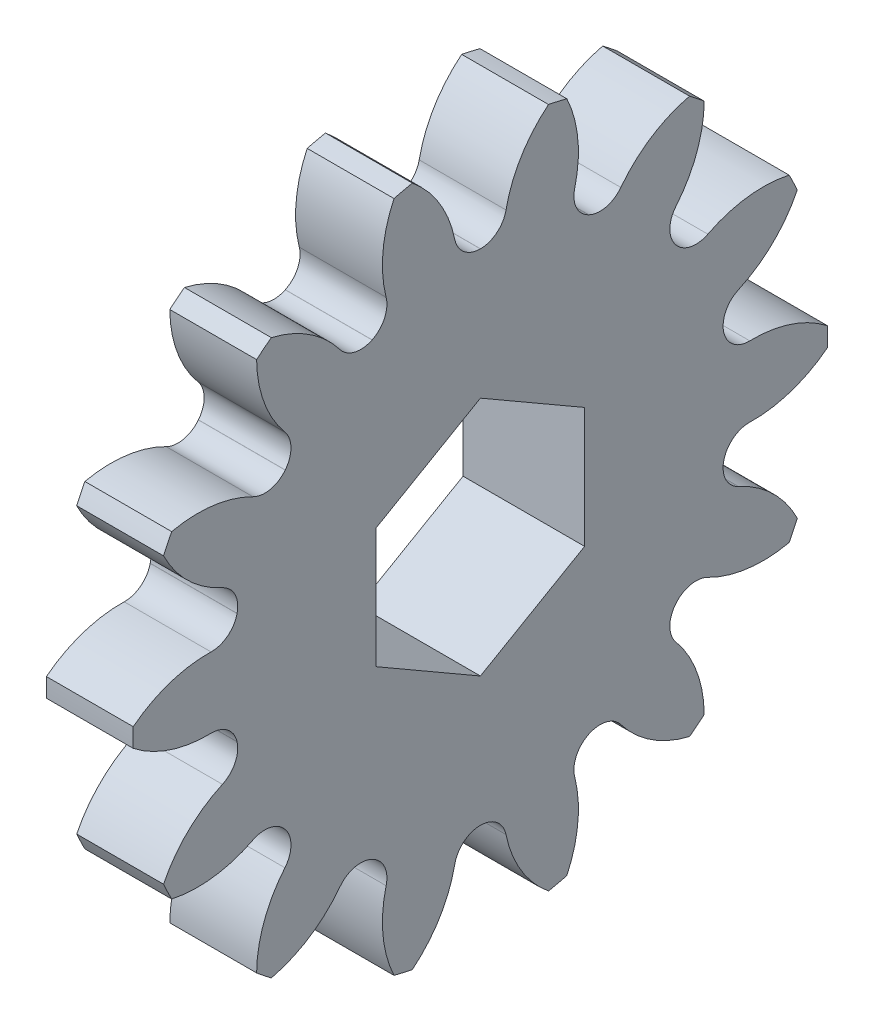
from build123d import *

# Parameters (mm, degrees)
SKETCH1_W           = 10
SKETCH1_H           = 40
CUT_EXTRUDE1_DEPTH  = 58.445626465
CUT_EXTRUDE2_DEPTH  = 58.445626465
CUT_EXTRUDE3_DEPTH  = 58.445626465
CUT_EXTRUDE4_DEPTH  = 58.445626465
CUT_EXTRUDE5_DEPTH  = 58.445626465
CUT_EXTRUDE6_DEPTH  = 58.445626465
CUT_EXTRUDE7_DEPTH  = 58.445626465
CUT_EXTRUDE8_DEPTH  = 58.445626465
CUT_EXTRUDE9_DEPTH  = 58.445626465
CUT_EXTRUDE10_DEPTH = 58.445626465
CUT_EXTRUDE11_DEPTH = 58.445626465
CUT_EXTRUDE12_DEPTH = 58.445626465
CUT_EXTRUDE13_DEPTH = 58.445626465
CUT_EXTRUDE14_DEPTH = 57.907686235
SKETCH16_R          = 19.5
BOSS_EXTRUDE1_DEPTH = 4
FILLET1_R           = 3
CUT_EXTRUDE16_DEPTH = 58.744997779


with BuildPart() as part:
    # Sketch1 → Revolve1 (revolve)
    with BuildSketch(Plane(origin=(0, 0, 0), x_dir=(-1, 0, 0), z_dir=(0, 0, -1)), mode=Mode.PRIVATE) as revolve1_sk:
        with Locations((-5, 20)):
            Rectangle(SKETCH1_W, SKETCH1_H)
    revolve(revolve1_sk.sketch.rotate(Axis((10, 0, 0), (-1, 0, 0)), 270), axis=Axis((10, 0, 0), (-1, 0, 0)))

    # Sketch2 → Cut-Extrude1 (cut, through all)
    with BuildSketch(Plane(origin=(10, 0, 0), x_dir=(0, 0, -1), z_dir=(1, 0, 0))):
        with BuildLine():
            ThreePointArc((35.556318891, 18.323432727), (31.273259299, 24.939592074), (25.7760513, 30.587500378))
            ThreePointArc((25.7760513, 30.587500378), (24.422511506, 24.701855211), (20.71573776, 19.933971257))
            ThreePointArc((20.71573776, 19.933971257), (22.476873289, 17.924708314), (24.043870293, 15.760625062))
            ThreePointArc((24.043870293, 15.760625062), (29.517048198, 18.313508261), (35.556318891, 18.323432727))
        make_face()
    extrude(amount=-CUT_EXTRUDE1_DEPTH, mode=Mode.SUBTRACT)

    # Sketch3 → Cut-Extrude2 (cut, through all)
    with BuildSketch(Plane(origin=(10, 0, 0), x_dir=(0, 0, -1), z_dir=(1, 0, 0))):
        with BuildLine():
            ThreePointArc((39.985375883, 1.08153385), (38.997116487, 8.900837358), (36.494838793, 16.37457607))
            ThreePointArc((36.494838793, 16.37457607), (32.721655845, 11.659071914), (27.313260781, 8.971665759))
            ThreePointArc((27.313260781, 8.971665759), (28.028202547, 6.39725433), (28.50105753, 3.767588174))
            ThreePointArc((28.50105753, 3.767588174), (34.539874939, 3.692933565), (39.985375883, 1.08153385))
        make_face()
    extrude(amount=-CUT_EXTRUDE2_DEPTH, mode=Mode.SUBTRACT)

    # Sketch4 → Cut-Extrude3 (cut, through all)
    with BuildSketch(Plane(origin=(10, 0, 0), x_dir=(0, 0, -1), z_dir=(1, 0, 0))):
        with BuildLine():
            ThreePointArc((36.494838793, -16.37457607), (38.997116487, -8.900837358), (39.985375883, -1.08153385))
            ThreePointArc((39.985375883, -1.08153385), (34.539874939, -3.692933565), (28.50105753, -3.767588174))
            ThreePointArc((28.50105753, -3.767588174), (28.028202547, -6.39725433), (27.313260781, -8.971665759))
            ThreePointArc((27.313260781, -8.971665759), (32.721655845, -11.659071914), (36.494838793, -16.37457607))
        make_face()
    extrude(amount=-CUT_EXTRUDE3_DEPTH, mode=Mode.SUBTRACT)

    # Sketch5 → Cut-Extrude4 (cut, through all)
    with BuildSketch(Plane(origin=(10, 0, 0), x_dir=(0, 0, -1), z_dir=(1, 0, 0))):
        with BuildLine():
            ThreePointArc((25.7760513, -30.587500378), (31.273259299, -24.939592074), (35.556318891, -18.323432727))
            ThreePointArc((35.556318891, -18.323432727), (29.517048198, -18.313508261), (24.043870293, -15.760625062))
            ThreePointArc((24.043870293, -15.760625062), (22.476873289, -17.924708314), (20.71573776, -19.933971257))
            ThreePointArc((20.71573776, -19.933971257), (24.422511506, -24.701855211), (25.7760513, -30.587500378))
        make_face()
    extrude(amount=-CUT_EXTRUDE4_DEPTH, mode=Mode.SUBTRACT)

    # Sketch6 → Cut-Extrude5 (cut, through all)
    with BuildSketch(Plane(origin=(10, 0, 0), x_dir=(0, 0, -1), z_dir=(1, 0, 0))):
        with BuildLine():
            ThreePointArc((9.952000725, -38.742195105), (17.355349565, -36.038754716), (24.084896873, -31.93615103))
            ThreePointArc((24.084896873, -31.93615103), (18.648008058, -29.306868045), (14.824499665, -24.632076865))
            ThreePointArc((14.824499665, -24.632076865), (12.473723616, -25.901953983), (10.015208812, -26.948109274))
            ThreePointArc((10.015208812, -26.948109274), (11.286189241, -32.852133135), (9.952000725, -38.742195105))
        make_face()
    extrude(amount=-CUT_EXTRUDE5_DEPTH, mode=Mode.SUBTRACT)

    # Sketch7 → Cut-Extrude6 (cut, through all)
    with BuildSketch(Plane(origin=(10, 0, 0), x_dir=(0, 0, -1), z_dir=(1, 0, 0))):
        with BuildLine():
            ThreePointArc((-7.843165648, -39.22352295), (0, -40), (7.843165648, -39.22352295))
            ThreePointArc((7.843165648, -39.22352295), (4.085501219, -34.495643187), (2.668955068, -28.624843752))
            ThreePointArc((2.668955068, -28.624843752), (0, -28.749), (-2.668955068, -28.624843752))
            ThreePointArc((-2.668955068, -28.624843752), (-4.085501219, -34.495643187), (-7.843165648, -39.22352295))
        make_face()
    extrude(amount=-CUT_EXTRUDE6_DEPTH, mode=Mode.SUBTRACT)

    # Sketch8 → Cut-Extrude7 (cut, through all)
    with BuildSketch(Plane(origin=(10, 0, 0), x_dir=(0, 0, -1), z_dir=(1, 0, 0))):
        with BuildLine():
            ThreePointArc((-24.084896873, -31.93615103), (-17.355349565, -36.038754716), (-9.952000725, -38.742195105))
            ThreePointArc((-9.952000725, -38.742195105), (-11.286189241, -32.852133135), (-10.015208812, -26.948109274))
            ThreePointArc((-10.015208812, -26.948109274), (-12.473723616, -25.901953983), (-14.824499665, -24.632076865))
            ThreePointArc((-14.824499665, -24.632076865), (-18.648008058, -29.306868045), (-24.084896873, -31.93615103))
        make_face()
    extrude(amount=-CUT_EXTRUDE7_DEPTH, mode=Mode.SUBTRACT)

    # Sketch9 → Cut-Extrude8 (cut, through all)
    with BuildSketch(Plane(origin=(10, 0, 0), x_dir=(0, 0, -1), z_dir=(1, 0, 0))):
        with BuildLine():
            ThreePointArc((-35.556318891, -18.323432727), (-31.273259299, -24.939592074), (-25.7760513, -30.587500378))
            ThreePointArc((-25.7760513, -30.587500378), (-24.422511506, -24.701855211), (-20.71573776, -19.933971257))
            ThreePointArc((-20.71573776, -19.933971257), (-22.476873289, -17.924708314), (-24.043870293, -15.760625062))
            ThreePointArc((-24.043870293, -15.760625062), (-29.517048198, -18.313508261), (-35.556318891, -18.323432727))
        make_face()
    extrude(amount=-CUT_EXTRUDE8_DEPTH, mode=Mode.SUBTRACT)

    # Sketch10 → Cut-Extrude9 (cut, through all)
    with BuildSketch(Plane(origin=(10, 0, 0), x_dir=(0, 0, -1), z_dir=(1, 0, 0))):
        with BuildLine():
            ThreePointArc((-39.985375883, -1.08153385), (-38.997116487, -8.900837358), (-36.494838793, -16.37457607))
            ThreePointArc((-36.494838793, -16.37457607), (-32.721655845, -11.659071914), (-27.313260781, -8.971665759))
            ThreePointArc((-27.313260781, -8.971665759), (-28.028202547, -6.39725433), (-28.50105753, -3.767588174))
            ThreePointArc((-28.50105753, -3.767588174), (-34.539874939, -3.692933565), (-39.985375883, -1.08153385))
        make_face()
    extrude(amount=-CUT_EXTRUDE9_DEPTH, mode=Mode.SUBTRACT)

    # Sketch11 → Cut-Extrude10 (cut, through all)
    with BuildSketch(Plane(origin=(10, 0, 0), x_dir=(0, 0, -1), z_dir=(1, 0, 0))):
        with BuildLine():
            ThreePointArc((-36.494838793, 16.37457607), (-38.997116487, 8.900837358), (-39.985375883, 1.08153385))
            ThreePointArc((-39.985375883, 1.08153385), (-34.539874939, 3.692933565), (-28.50105753, 3.767588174))
            ThreePointArc((-28.50105753, 3.767588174), (-28.028202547, 6.39725433), (-27.313260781, 8.971665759))
            ThreePointArc((-27.313260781, 8.971665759), (-32.721655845, 11.659071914), (-36.494838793, 16.37457607))
        make_face()
    extrude(amount=-CUT_EXTRUDE10_DEPTH, mode=Mode.SUBTRACT)

    # Sketch12 → Cut-Extrude11 (cut, through all)
    with BuildSketch(Plane(origin=(10, 0, 0), x_dir=(0, 0, -1), z_dir=(1, 0, 0))):
        with BuildLine():
            ThreePointArc((-25.7760513, 30.587500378), (-31.273259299, 24.939592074), (-35.556318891, 18.323432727))
            ThreePointArc((-35.556318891, 18.323432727), (-29.517048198, 18.313508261), (-24.043870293, 15.760625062))
            ThreePointArc((-24.043870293, 15.760625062), (-22.476873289, 17.924708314), (-20.71573776, 19.933971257))
            ThreePointArc((-20.71573776, 19.933971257), (-24.422511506, 24.701855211), (-25.7760513, 30.587500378))
        make_face()
    extrude(amount=-CUT_EXTRUDE11_DEPTH, mode=Mode.SUBTRACT)

    # Sketch13 → Cut-Extrude12 (cut, through all)
    with BuildSketch(Plane(origin=(10, 0, 0), x_dir=(0, 0, -1), z_dir=(1, 0, 0))):
        with BuildLine():
            ThreePointArc((-9.952000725, 38.742195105), (-17.355349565, 36.038754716), (-24.084896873, 31.93615103))
            ThreePointArc((-24.084896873, 31.93615103), (-18.648008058, 29.306868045), (-14.824499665, 24.632076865))
            ThreePointArc((-14.824499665, 24.632076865), (-12.473723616, 25.901953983), (-10.015208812, 26.948109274))
            ThreePointArc((-10.015208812, 26.948109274), (-11.286189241, 32.852133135), (-9.952000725, 38.742195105))
        make_face()
    extrude(amount=-CUT_EXTRUDE12_DEPTH, mode=Mode.SUBTRACT)

    # Sketch14 → Cut-Extrude13 (cut, through all)
    with BuildSketch(Plane(origin=(10, 0, 0), x_dir=(0, 0, -1), z_dir=(1, 0, 0))):
        with BuildLine():
            ThreePointArc((7.843165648, 39.22352295), (0, 40), (-7.843165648, 39.22352295))
            ThreePointArc((-7.843165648, 39.22352295), (-4.085501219, 34.495643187), (-2.668955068, 28.624843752))
            ThreePointArc((-2.668955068, 28.624843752), (0, 28.749), (2.668955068, 28.624843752))
            ThreePointArc((2.668955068, 28.624843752), (4.085501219, 34.495643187), (7.843165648, 39.22352295))
        make_face()
    extrude(amount=-CUT_EXTRUDE13_DEPTH, mode=Mode.SUBTRACT)

    # Sketch15 → Cut-Extrude14 (cut, through all)
    with BuildSketch(Plane(origin=(10, 0, 0), x_dir=(0, 0, -1), z_dir=(1, 0, 0))):
        with BuildLine():
            ThreePointArc((24.084896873, 31.93615103), (17.355349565, 36.038754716), (9.952000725, 38.742195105))
            ThreePointArc((9.952000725, 38.742195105), (11.286189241, 32.852133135), (10.015208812, 26.948109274))
            ThreePointArc((10.015208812, 26.948109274), (12.473723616, 25.901953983), (14.824499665, 24.632076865))
            ThreePointArc((14.824499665, 24.632076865), (18.648008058, 29.306868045), (24.084896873, 31.93615103))
        make_face()
    extrude(amount=-CUT_EXTRUDE14_DEPTH, mode=Mode.SUBTRACT)

    # Sketch16 → Boss-Extrude1 (add)
    with BuildSketch(Plane.ZY):
        Circle(SKETCH16_R)
    extrude(amount=BOSS_EXTRUDE1_DEPTH)

    # Fillet1
    fillet1_edges = [part.edges().sort_by_distance(p)[0] for p in [
        (5, -24.632076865, 14.824499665),
        (5, -26.948109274, 10.015208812),
        (5, -15.760625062, 24.043870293),
        (5, -19.933971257, 20.71573776),
        (5, 15.760625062, -24.043870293),
        (5, 19.933971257, -20.71573776),
        (5, -3.767588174, 28.50105753),
        (5, -8.971665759, 27.313260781),
        (5, 8.971665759, 27.313260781),
        (5, 3.767588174, 28.50105753),
        (5, 19.933971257, 20.71573776),
        (5, 15.760625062, 24.043870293),
        (5, 26.948109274, 10.015208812),
        (5, 24.632076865, 14.824499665),
        (5, 28.624843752, -2.668955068),
        (5, 28.624843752, 2.668955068),
        (5, 24.632076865, -14.824499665),
        (5, 26.948109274, -10.015208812),
        (5, 3.767588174, -28.50105753),
        (5, 8.971665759, -27.313260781),
        (5, -8.971665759, -27.313260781),
        (5, -3.767588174, -28.50105753),
        (5, -19.933971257, -20.71573776),
        (5, -15.760625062, -24.043870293),
        (5, -26.948109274, -10.015208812),
        (5, -24.632076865, -14.824499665),
        (5, -28.624843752, 2.668955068),
        (5, -28.624843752, -2.668955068),
    ]]
    fillet(fillet1_edges, radius=FILLET1_R)

    # Sketch17 → Cut-Extrude16 (cut, through all)
    with BuildSketch(Plane(origin=(10, 0, 0), x_dir=(0, 0, -1), z_dir=(1, 0, 0))):
        Polygon((0, 13.856406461), (-12, 6.92820323), (-12, -6.92820323), (0, -13.856406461), (12, -6.92820323), (12, 6.92820323), align=None)
    extrude(amount=-CUT_EXTRUDE16_DEPTH, mode=Mode.SUBTRACT)


solid = part.part
